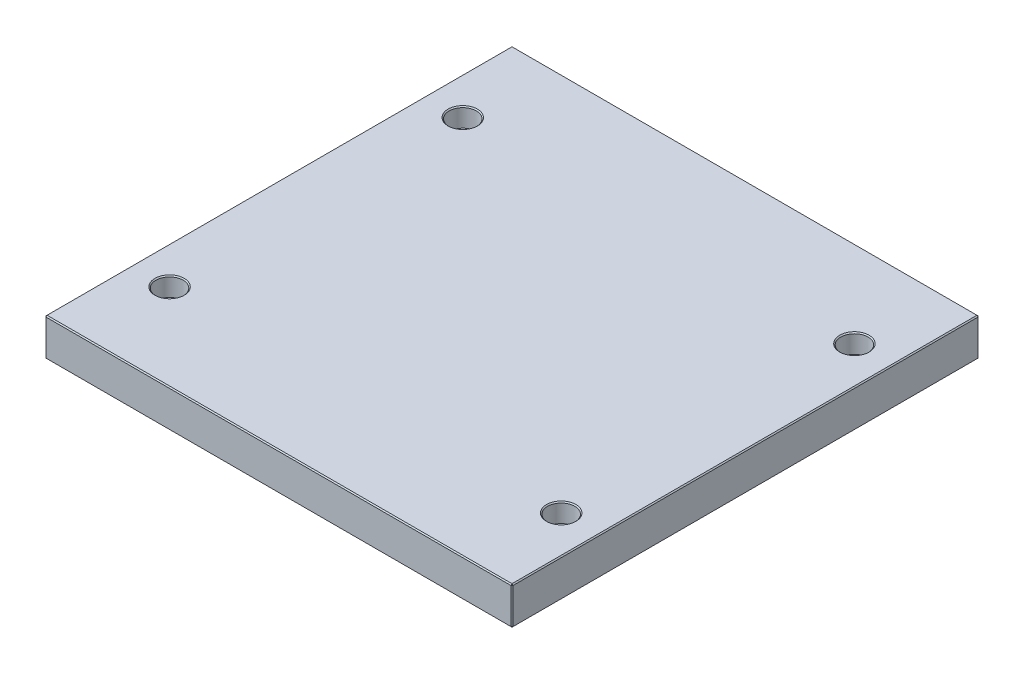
ISO-10303-21;
HEADER;
FILE_DESCRIPTION(('STEP AP214'),'2;1');
FILE_NAME('part.step','',(''),(''),'','','');
FILE_SCHEMA(('AUTOMOTIVE_DESIGN { 1 0 10303 214 1 1 1 1 }'));
ENDSEC;
DATA;
#1=APPLICATION_CONTEXT('core data for automotive mechanical design processes');
#2=APPLICATION_PROTOCOL_DEFINITION('international standard','automotive_design',2000,#1);
#3=PRODUCT_CONTEXT('',#1,'mechanical');
#4=PRODUCT('Part','Part','',(#3));
#5=PRODUCT_RELATED_PRODUCT_CATEGORY('part','',(#4));
#6=PRODUCT_DEFINITION_FORMATION('','',#4);
#7=PRODUCT_DEFINITION_CONTEXT('part definition',#1,'design');
#8=PRODUCT_DEFINITION('design','',#6,#7);
#9=PRODUCT_DEFINITION_SHAPE('','',#8);
#10=(LENGTH_UNIT() NAMED_UNIT(*) SI_UNIT(.MILLI.,.METRE.));
#11=(NAMED_UNIT(*) PLANE_ANGLE_UNIT() SI_UNIT($,.RADIAN.));
#12=(NAMED_UNIT(*) SI_UNIT($,.STERADIAN.) SOLID_ANGLE_UNIT());
#13=UNCERTAINTY_MEASURE_WITH_UNIT(LENGTH_MEASURE(1.E-05),#10,'distance_accuracy_value','');
#14=(GEOMETRIC_REPRESENTATION_CONTEXT(3) GLOBAL_UNCERTAINTY_ASSIGNED_CONTEXT((#13)) GLOBAL_UNIT_ASSIGNED_CONTEXT((#10,
#11,#12)) REPRESENTATION_CONTEXT('',''));
#15=CARTESIAN_POINT('',(0.,0.,0.));
#16=DIRECTION('',(0.,0.,1.));
#17=DIRECTION('',(1.,0.,0.));
#18=AXIS2_PLACEMENT_3D('',#15,#16,#17);
#19=CARTESIAN_POINT('',(-223.,36.,223.));
#20=DIRECTION('',(1.,0.,0.));
#21=DIRECTION('',(0.,0.,-1.));
#22=AXIS2_PLACEMENT_3D('',#19,#20,#21);
#23=PLANE('',#22);
#24=DIRECTION('',(0.,-1.,0.));
#25=VECTOR('',#24,1.);
#26=CARTESIAN_POINT('',(-223.,36.,-222.));
#27=LINE('',#26,#25);
#28=CARTESIAN_POINT('',(-223.,35.,-222.));
#29=VERTEX_POINT('',#28);
#30=CARTESIAN_POINT('',(-223.,1.,-222.));
#31=VERTEX_POINT('',#30);
#32=EDGE_CURVE('E115',#29,#31,#27,.T.);
#33=ORIENTED_EDGE('',*,*,#32,.T.);
#34=DIRECTION('',(0.,0.,1.));
#35=VECTOR('',#34,1.);
#36=CARTESIAN_POINT('',(-223.,1.,223.));
#37=LINE('',#36,#35);
#38=CARTESIAN_POINT('',(-223.,1.,222.));
#39=VERTEX_POINT('',#38);
#40=EDGE_CURVE('E111',#31,#39,#37,.T.);
#41=ORIENTED_EDGE('',*,*,#40,.T.);
#42=DIRECTION('',(0.,1.,0.));
#43=VECTOR('',#42,1.);
#44=CARTESIAN_POINT('',(-223.,36.,222.));
#45=LINE('',#44,#43);
#46=CARTESIAN_POINT('',(-223.,35.,222.));
#47=VERTEX_POINT('',#46);
#48=EDGE_CURVE('E104',#39,#47,#45,.T.);
#49=ORIENTED_EDGE('',*,*,#48,.T.);
#50=DIRECTION('',(0.,0.,-1.));
#51=VECTOR('',#50,1.);
#52=CARTESIAN_POINT('',(-223.,35.,-223.));
#53=LINE('',#52,#51);
#54=EDGE_CURVE('E108',#47,#29,#53,.T.);
#55=ORIENTED_EDGE('',*,*,#54,.T.);
#56=EDGE_LOOP('',(#33,#41,#49,#55));
#57=FACE_BOUND('',#56,.T.);
#58=ADVANCED_FACE('F16',(#57),#23,.F.);
#59=CARTESIAN_POINT('',(223.,36.,223.));
#60=DIRECTION('',(0.,0.,-1.));
#61=DIRECTION('',(-1.,0.,0.));
#62=AXIS2_PLACEMENT_3D('',#59,#60,#61);
#63=PLANE('',#62);
#64=DIRECTION('',(-1.,0.,0.));
#65=VECTOR('',#64,1.);
#66=CARTESIAN_POINT('',(-223.,35.,223.));
#67=LINE('',#66,#65);
#68=CARTESIAN_POINT('',(222.,35.,223.));
#69=VERTEX_POINT('',#68);
#70=CARTESIAN_POINT('',(-222.,35.,223.));
#71=VERTEX_POINT('',#70);
#72=EDGE_CURVE('E170',#69,#71,#67,.T.);
#73=ORIENTED_EDGE('',*,*,#72,.T.);
#74=DIRECTION('',(0.,-1.,0.));
#75=VECTOR('',#74,1.);
#76=CARTESIAN_POINT('',(-222.,36.,223.));
#77=LINE('',#76,#75);
#78=CARTESIAN_POINT('',(-222.,1.,223.));
#79=VERTEX_POINT('',#78);
#80=EDGE_CURVE('E123',#71,#79,#77,.T.);
#81=ORIENTED_EDGE('',*,*,#80,.T.);
#82=DIRECTION('',(1.,0.,0.));
#83=VECTOR('',#82,1.);
#84=CARTESIAN_POINT('',(223.,1.,223.));
#85=LINE('',#84,#83);
#86=CARTESIAN_POINT('',(222.,1.,223.));
#87=VERTEX_POINT('',#86);
#88=EDGE_CURVE('E174',#79,#87,#85,.T.);
#89=ORIENTED_EDGE('',*,*,#88,.T.);
#90=DIRECTION('',(0.,1.,0.));
#91=VECTOR('',#90,1.);
#92=CARTESIAN_POINT('',(222.,36.,223.));
#93=LINE('',#92,#91);
#94=EDGE_CURVE('E172',#87,#69,#93,.T.);
#95=ORIENTED_EDGE('',*,*,#94,.T.);
#96=EDGE_LOOP('',(#73,#81,#89,#95));
#97=FACE_BOUND('',#96,.T.);
#98=ADVANCED_FACE('F317',(#97),#63,.F.);
#99=CARTESIAN_POINT('',(223.,36.,223.));
#100=DIRECTION('',(-1.,0.,0.));
#101=DIRECTION('',(0.,0.,1.));
#102=AXIS2_PLACEMENT_3D('',#99,#100,#101);
#103=PLANE('',#102);
#104=DIRECTION('',(0.,0.,-1.));
#105=VECTOR('',#104,1.);
#106=CARTESIAN_POINT('',(223.,1.,223.));
#107=LINE('',#106,#105);
#108=CARTESIAN_POINT('',(223.,1.,222.));
#109=VERTEX_POINT('',#108);
#110=CARTESIAN_POINT('',(223.,1.,-222.));
#111=VERTEX_POINT('',#110);
#112=EDGE_CURVE('E165',#109,#111,#107,.T.);
#113=ORIENTED_EDGE('',*,*,#112,.T.);
#114=DIRECTION('',(0.,1.,0.));
#115=VECTOR('',#114,1.);
#116=CARTESIAN_POINT('',(223.,36.,-222.));
#117=LINE('',#116,#115);
#118=CARTESIAN_POINT('',(223.,35.,-222.));
#119=VERTEX_POINT('',#118);
#120=EDGE_CURVE('E167',#111,#119,#117,.T.);
#121=ORIENTED_EDGE('',*,*,#120,.T.);
#122=DIRECTION('',(0.,0.,1.));
#123=VECTOR('',#122,1.);
#124=CARTESIAN_POINT('',(223.,35.,223.));
#125=LINE('',#124,#123);
#126=CARTESIAN_POINT('',(223.,35.,222.));
#127=VERTEX_POINT('',#126);
#128=EDGE_CURVE('E161',#119,#127,#125,.T.);
#129=ORIENTED_EDGE('',*,*,#128,.T.);
#130=DIRECTION('',(0.,-1.,0.));
#131=VECTOR('',#130,1.);
#132=CARTESIAN_POINT('',(223.,36.,222.));
#133=LINE('',#132,#131);
#134=EDGE_CURVE('E163',#127,#109,#133,.T.);
#135=ORIENTED_EDGE('',*,*,#134,.T.);
#136=EDGE_LOOP('',(#113,#121,#129,#135));
#137=FACE_BOUND('',#136,.T.);
#138=ADVANCED_FACE('F323',(#137),#103,.F.);
#139=CARTESIAN_POINT('',(223.,36.,-223.));
#140=DIRECTION('',(0.,0.,1.));
#141=DIRECTION('',(1.,0.,0.));
#142=AXIS2_PLACEMENT_3D('',#139,#140,#141);
#143=PLANE('',#142);
#144=DIRECTION('',(0.,-1.,0.));
#145=VECTOR('',#144,1.);
#146=CARTESIAN_POINT('',(222.,36.,-223.));
#147=LINE('',#146,#145);
#148=CARTESIAN_POINT('',(222.,35.,-223.));
#149=VERTEX_POINT('',#148);
#150=CARTESIAN_POINT('',(222.,1.,-223.));
#151=VERTEX_POINT('',#150);
#152=EDGE_CURVE('E154',#149,#151,#147,.T.);
#153=ORIENTED_EDGE('',*,*,#152,.T.);
#154=DIRECTION('',(-1.,0.,0.));
#155=VECTOR('',#154,1.);
#156=CARTESIAN_POINT('',(223.,1.,-223.));
#157=LINE('',#156,#155);
#158=CARTESIAN_POINT('',(-222.,1.,-223.));
#159=VERTEX_POINT('',#158);
#160=EDGE_CURVE('E159',#151,#159,#157,.T.);
#161=ORIENTED_EDGE('',*,*,#160,.T.);
#162=DIRECTION('',(0.,1.,0.));
#163=VECTOR('',#162,1.);
#164=CARTESIAN_POINT('',(-222.,36.,-223.));
#165=LINE('',#164,#163);
#166=CARTESIAN_POINT('',(-222.,35.,-223.));
#167=VERTEX_POINT('',#166);
#168=EDGE_CURVE('E156',#159,#167,#165,.T.);
#169=ORIENTED_EDGE('',*,*,#168,.T.);
#170=DIRECTION('',(1.,0.,0.));
#171=VECTOR('',#170,1.);
#172=CARTESIAN_POINT('',(223.,35.,-223.));
#173=LINE('',#172,#171);
#174=EDGE_CURVE('E152',#167,#149,#173,.T.);
#175=ORIENTED_EDGE('',*,*,#174,.T.);
#176=EDGE_LOOP('',(#153,#161,#169,#175));
#177=FACE_BOUND('',#176,.T.);
#178=ADVANCED_FACE('F465',(#177),#143,.F.);
#179=CARTESIAN_POINT('',(0.,36.,0.));
#180=DIRECTION('',(0.,1.,0.));
#181=DIRECTION('',(0.,0.,1.));
#182=AXIS2_PLACEMENT_3D('',#179,#180,#181);
#183=PLANE('',#182);
#184=CARTESIAN_POINT('',(-187.,36.,140.));
#185=DIRECTION('',(0.,1.,0.));
#186=DIRECTION('',(0.,0.,1.));
#187=AXIS2_PLACEMENT_3D('',#184,#185,#186);
#188=CIRCLE('',#187,14.);
#189=CARTESIAN_POINT('',(-187.,36.,154.));
#190=VERTEX_POINT('',#189);
#191=EDGE_CURVE('E290',#190,#190,#188,.F.);
#192=ORIENTED_EDGE('',*,*,#191,.T.);
#193=EDGE_LOOP('',(#192));
#194=FACE_BOUND('',#193,.T.);
#195=CARTESIAN_POINT('',(187.,36.,140.));
#196=DIRECTION('',(0.,1.,0.));
#197=DIRECTION('',(0.,0.,1.));
#198=AXIS2_PLACEMENT_3D('',#195,#196,#197);
#199=CIRCLE('',#198,14.);
#200=CARTESIAN_POINT('',(187.,36.,154.));
#201=VERTEX_POINT('',#200);
#202=EDGE_CURVE('E287',#201,#201,#199,.F.);
#203=ORIENTED_EDGE('',*,*,#202,.T.);
#204=EDGE_LOOP('',(#203));
#205=FACE_BOUND('',#204,.T.);
#206=CARTESIAN_POINT('',(187.,36.,-140.));
#207=DIRECTION('',(0.,1.,0.));
#208=DIRECTION('',(0.,0.,1.));
#209=AXIS2_PLACEMENT_3D('',#206,#207,#208);
#210=CIRCLE('',#209,14.);
#211=CARTESIAN_POINT('',(187.,36.,-126.));
#212=VERTEX_POINT('',#211);
#213=EDGE_CURVE('E284',#212,#212,#210,.F.);
#214=ORIENTED_EDGE('',*,*,#213,.T.);
#215=EDGE_LOOP('',(#214));
#216=FACE_BOUND('',#215,.T.);
#217=CARTESIAN_POINT('',(-187.,36.,-140.));
#218=DIRECTION('',(0.,1.,0.));
#219=DIRECTION('',(0.,0.,1.));
#220=AXIS2_PLACEMENT_3D('',#217,#218,#219);
#221=CIRCLE('',#220,14.);
#222=CARTESIAN_POINT('',(-187.,36.,-126.));
#223=VERTEX_POINT('',#222);
#224=EDGE_CURVE('E281',#223,#223,#221,.F.);
#225=ORIENTED_EDGE('',*,*,#224,.T.);
#226=EDGE_LOOP('',(#225));
#227=FACE_BOUND('',#226,.T.);
#228=DIRECTION('',(0.,0.,-1.));
#229=VECTOR('',#228,1.);
#230=CARTESIAN_POINT('',(222.,36.,-223.));
#231=LINE('',#230,#229);
#232=CARTESIAN_POINT('',(222.,36.,222.));
#233=VERTEX_POINT('',#232);
#234=CARTESIAN_POINT('',(222.,36.,-222.));
#235=VERTEX_POINT('',#234);
#236=EDGE_CURVE('E31',#233,#235,#231,.T.);
#237=ORIENTED_EDGE('',*,*,#236,.T.);
#238=DIRECTION('',(-1.,0.,0.));
#239=VECTOR('',#238,1.);
#240=CARTESIAN_POINT('',(-223.,36.,-222.));
#241=LINE('',#240,#239);
#242=CARTESIAN_POINT('',(-222.,36.,-222.));
#243=VERTEX_POINT('',#242);
#244=EDGE_CURVE('E190',#235,#243,#241,.T.);
#245=ORIENTED_EDGE('',*,*,#244,.T.);
#246=DIRECTION('',(0.,0.,1.));
#247=VECTOR('',#246,1.);
#248=CARTESIAN_POINT('',(-222.,36.,223.));
#249=LINE('',#248,#247);
#250=CARTESIAN_POINT('',(-222.,36.,222.));
#251=VERTEX_POINT('',#250);
#252=EDGE_CURVE('E186',#243,#251,#249,.T.);
#253=ORIENTED_EDGE('',*,*,#252,.T.);
#254=DIRECTION('',(1.,0.,0.));
#255=VECTOR('',#254,1.);
#256=CARTESIAN_POINT('',(223.,36.,222.));
#257=LINE('',#256,#255);
#258=EDGE_CURVE('E36',#251,#233,#257,.T.);
#259=ORIENTED_EDGE('',*,*,#258,.T.);
#260=EDGE_LOOP('',(#237,#245,#253,#259));
#261=FACE_BOUND('',#260,.T.);
#262=ADVANCED_FACE('F462',(#194,#205,#216,#227,#261),#183,.T.);
#263=CARTESIAN_POINT('',(0.,0.,0.));
#264=DIRECTION('',(0.,1.,0.));
#265=DIRECTION('',(0.,0.,1.));
#266=AXIS2_PLACEMENT_3D('',#263,#264,#265);
#267=PLANE('',#266);
#268=CARTESIAN_POINT('',(187.,0.,-140.));
#269=DIRECTION('',(0.,1.,0.));
#270=DIRECTION('',(0.,0.,1.));
#271=AXIS2_PLACEMENT_3D('',#268,#269,#270);
#272=CIRCLE('',#271,10.0000000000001);
#273=CARTESIAN_POINT('',(187.,0.,-130.));
#274=VERTEX_POINT('',#273);
#275=EDGE_CURVE('E263',#274,#274,#272,.T.);
#276=ORIENTED_EDGE('',*,*,#275,.T.);
#277=EDGE_LOOP('',(#276));
#278=FACE_BOUND('',#277,.T.);
#279=CARTESIAN_POINT('',(187.,0.,140.));
#280=DIRECTION('',(0.,1.,0.));
#281=DIRECTION('',(0.,0.,1.));
#282=AXIS2_PLACEMENT_3D('',#279,#280,#281);
#283=CIRCLE('',#282,10.0000000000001);
#284=CARTESIAN_POINT('',(187.,0.,150.));
#285=VERTEX_POINT('',#284);
#286=EDGE_CURVE('E260',#285,#285,#283,.T.);
#287=ORIENTED_EDGE('',*,*,#286,.T.);
#288=EDGE_LOOP('',(#287));
#289=FACE_BOUND('',#288,.T.);
#290=CARTESIAN_POINT('',(-187.,0.,140.));
#291=DIRECTION('',(0.,1.,0.));
#292=DIRECTION('',(0.,0.,1.));
#293=AXIS2_PLACEMENT_3D('',#290,#291,#292);
#294=CIRCLE('',#293,10.0000000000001);
#295=CARTESIAN_POINT('',(-187.,0.,150.));
#296=VERTEX_POINT('',#295);
#297=EDGE_CURVE('E257',#296,#296,#294,.T.);
#298=ORIENTED_EDGE('',*,*,#297,.T.);
#299=EDGE_LOOP('',(#298));
#300=FACE_BOUND('',#299,.T.);
#301=CARTESIAN_POINT('',(-187.,0.,-140.));
#302=DIRECTION('',(0.,1.,0.));
#303=DIRECTION('',(0.,0.,1.));
#304=AXIS2_PLACEMENT_3D('',#301,#302,#303);
#305=CIRCLE('',#304,10.0000000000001);
#306=CARTESIAN_POINT('',(-187.,0.,-130.));
#307=VERTEX_POINT('',#306);
#308=EDGE_CURVE('E192',#307,#307,#305,.T.);
#309=ORIENTED_EDGE('',*,*,#308,.T.);
#310=EDGE_LOOP('',(#309));
#311=FACE_BOUND('',#310,.T.);
#312=DIRECTION('',(0.,0.,1.));
#313=VECTOR('',#312,1.);
#314=CARTESIAN_POINT('',(222.,0.,0.));
#315=LINE('',#314,#313);
#316=CARTESIAN_POINT('',(222.,0.,-222.));
#317=VERTEX_POINT('',#316);
#318=CARTESIAN_POINT('',(222.,0.,222.));
#319=VERTEX_POINT('',#318);
#320=EDGE_CURVE('E177',#317,#319,#315,.T.);
#321=ORIENTED_EDGE('',*,*,#320,.T.);
#322=DIRECTION('',(-1.,0.,0.));
#323=VECTOR('',#322,1.);
#324=CARTESIAN_POINT('',(0.,0.,222.));
#325=LINE('',#324,#323);
#326=CARTESIAN_POINT('',(-222.,0.,222.));
#327=VERTEX_POINT('',#326);
#328=EDGE_CURVE('E183',#319,#327,#325,.T.);
#329=ORIENTED_EDGE('',*,*,#328,.T.);
#330=DIRECTION('',(0.,0.,-1.));
#331=VECTOR('',#330,1.);
#332=CARTESIAN_POINT('',(-222.,0.,0.));
#333=LINE('',#332,#331);
#334=CARTESIAN_POINT('',(-222.,0.,-222.));
#335=VERTEX_POINT('',#334);
#336=EDGE_CURVE('E181',#327,#335,#333,.T.);
#337=ORIENTED_EDGE('',*,*,#336,.T.);
#338=DIRECTION('',(1.,0.,0.));
#339=VECTOR('',#338,1.);
#340=CARTESIAN_POINT('',(0.,0.,-222.));
#341=LINE('',#340,#339);
#342=EDGE_CURVE('E179',#335,#317,#341,.T.);
#343=ORIENTED_EDGE('',*,*,#342,.T.);
#344=EDGE_LOOP('',(#321,#329,#337,#343));
#345=FACE_BOUND('',#344,.T.);
#346=ADVANCED_FACE('F402',(#278,#289,#300,#311,#345),#267,.F.);
#347=CARTESIAN_POINT('',(223.,36.,222.));
#348=DIRECTION('',(-0.707106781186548,0.,-0.707106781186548));
#349=DIRECTION('',(0.,-1.,0.));
#350=AXIS2_PLACEMENT_3D('',#347,#348,#349);
#351=PLANE('',#350);
#352=DIRECTION('',(-0.707106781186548,0.,0.707106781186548));
#353=VECTOR('',#352,1.);
#354=CARTESIAN_POINT('',(222.,35.,223.));
#355=LINE('',#354,#353);
#356=EDGE_CURVE('E141',#69,#127,#355,.F.);
#357=ORIENTED_EDGE('',*,*,#356,.F.);
#358=ORIENTED_EDGE('',*,*,#94,.F.);
#359=DIRECTION('',(0.707106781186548,0.,-0.707106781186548));
#360=VECTOR('',#359,1.);
#361=CARTESIAN_POINT('',(222.,1.,223.));
#362=LINE('',#361,#360);
#363=EDGE_CURVE('E144',#109,#87,#362,.F.);
#364=ORIENTED_EDGE('',*,*,#363,.F.);
#365=ORIENTED_EDGE('',*,*,#134,.F.);
#366=EDGE_LOOP('',(#357,#358,#364,#365));
#367=FACE_BOUND('',#366,.T.);
#368=ADVANCED_FACE('F398',(#367),#351,.F.);
#369=CARTESIAN_POINT('',(222.,35.,223.));
#370=DIRECTION('',(0.577350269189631,0.577350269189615,0.577350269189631));
#371=DIRECTION('',(0.707106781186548,0.,-0.707106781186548));
#372=AXIS2_PLACEMENT_3D('',#369,#370,#371);
#373=PLANE('',#372);
#374=DIRECTION('',(0.,-0.707106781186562,0.707106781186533));
#375=VECTOR('',#374,1.);
#376=CARTESIAN_POINT('',(222.,35.,223.));
#377=LINE('',#376,#375);
#378=EDGE_CURVE('E235',#69,#233,#377,.F.);
#379=ORIENTED_EDGE('',*,*,#378,.F.);
#380=ORIENTED_EDGE('',*,*,#356,.T.);
#381=DIRECTION('',(-0.707106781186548,0.707106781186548,0.));
#382=VECTOR('',#381,1.);
#383=CARTESIAN_POINT('',(222.5,35.5,222.));
#384=LINE('',#383,#382);
#385=EDGE_CURVE('E237',#233,#127,#384,.F.);
#386=ORIENTED_EDGE('',*,*,#385,.F.);
#387=EDGE_LOOP('',(#379,#380,#386));
#388=FACE_BOUND('',#387,.T.);
#389=ADVANCED_FACE('F394',(#388),#373,.T.);
#390=CARTESIAN_POINT('',(222.,1.,223.));
#391=DIRECTION('',(0.577350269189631,-0.577350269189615,0.577350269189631));
#392=DIRECTION('',(0.707106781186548,0.,-0.707106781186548));
#393=AXIS2_PLACEMENT_3D('',#390,#391,#392);
#394=PLANE('',#393);
#395=DIRECTION('',(-0.707106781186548,-0.707106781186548,0.));
#396=VECTOR('',#395,1.);
#397=CARTESIAN_POINT('',(222.5,0.499999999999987,222.));
#398=LINE('',#397,#396);
#399=EDGE_CURVE('E229',#109,#319,#398,.T.);
#400=ORIENTED_EDGE('',*,*,#399,.F.);
#401=ORIENTED_EDGE('',*,*,#363,.T.);
#402=DIRECTION('',(0.,0.707106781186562,0.707106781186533));
#403=VECTOR('',#402,1.);
#404=CARTESIAN_POINT('',(222.,1.,223.));
#405=LINE('',#404,#403);
#406=EDGE_CURVE('E232',#319,#87,#405,.T.);
#407=ORIENTED_EDGE('',*,*,#406,.F.);
#408=EDGE_LOOP('',(#400,#401,#407));
#409=FACE_BOUND('',#408,.T.);
#410=ADVANCED_FACE('F390',(#409),#394,.T.);
#411=CARTESIAN_POINT('',(222.,36.,0.));
#412=DIRECTION('',(0.707106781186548,0.707106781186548,0.));
#413=DIRECTION('',(0.,0.,1.));
#414=AXIS2_PLACEMENT_3D('',#411,#412,#413);
#415=PLANE('',#414);
#416=ORIENTED_EDGE('',*,*,#385,.T.);
#417=ORIENTED_EDGE('',*,*,#128,.F.);
#418=DIRECTION('',(0.707106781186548,-0.707106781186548,0.));
#419=VECTOR('',#418,1.);
#420=CARTESIAN_POINT('',(223.,35.,-222.));
#421=LINE('',#420,#419);
#422=EDGE_CURVE('E224',#235,#119,#421,.T.);
#423=ORIENTED_EDGE('',*,*,#422,.F.);
#424=ORIENTED_EDGE('',*,*,#236,.F.);
#425=EDGE_LOOP('',(#416,#417,#423,#424));
#426=FACE_BOUND('',#425,.T.);
#427=ADVANCED_FACE('F386',(#426),#415,.T.);
#428=CARTESIAN_POINT('',(0.,36.,222.));
#429=DIRECTION('',(0.,0.707106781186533,0.707106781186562));
#430=DIRECTION('',(-1.,0.,0.));
#431=AXIS2_PLACEMENT_3D('',#428,#429,#430);
#432=PLANE('',#431);
#433=ORIENTED_EDGE('',*,*,#378,.T.);
#434=ORIENTED_EDGE('',*,*,#258,.F.);
#435=DIRECTION('',(0.,0.707106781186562,-0.707106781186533));
#436=VECTOR('',#435,1.);
#437=CARTESIAN_POINT('',(-222.,35.5,222.5));
#438=LINE('',#437,#436);
#439=EDGE_CURVE('E127',#71,#251,#438,.T.);
#440=ORIENTED_EDGE('',*,*,#439,.F.);
#441=ORIENTED_EDGE('',*,*,#72,.F.);
#442=EDGE_LOOP('',(#433,#434,#440,#441));
#443=FACE_BOUND('',#442,.T.);
#444=ADVANCED_FACE('F383',(#443),#432,.T.);
#445=CARTESIAN_POINT('',(-222.,36.,223.));
#446=DIRECTION('',(0.707106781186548,0.,-0.707106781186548));
#447=DIRECTION('',(0.,-1.,0.));
#448=AXIS2_PLACEMENT_3D('',#445,#446,#447);
#449=PLANE('',#448);
#450=DIRECTION('',(0.707106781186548,0.,0.707106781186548));
#451=VECTOR('',#450,1.);
#452=CARTESIAN_POINT('',(-222.,1.,223.));
#453=LINE('',#452,#451);
#454=EDGE_CURVE('E128',#79,#39,#453,.F.);
#455=ORIENTED_EDGE('',*,*,#454,.F.);
#456=ORIENTED_EDGE('',*,*,#80,.F.);
#457=DIRECTION('',(-0.707106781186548,0.,-0.707106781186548));
#458=VECTOR('',#457,1.);
#459=CARTESIAN_POINT('',(-223.,35.,222.));
#460=LINE('',#459,#458);
#461=EDGE_CURVE('E119',#47,#71,#460,.F.);
#462=ORIENTED_EDGE('',*,*,#461,.F.);
#463=ORIENTED_EDGE('',*,*,#48,.F.);
#464=EDGE_LOOP('',(#455,#456,#462,#463));
#465=FACE_BOUND('',#464,.T.);
#466=ADVANCED_FACE('F121',(#465),#449,.F.);
#467=CARTESIAN_POINT('',(223.,1.,223.));
#468=DIRECTION('',(0.,0.707106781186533,-0.707106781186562));
#469=DIRECTION('',(1.,0.,0.));
#470=AXIS2_PLACEMENT_3D('',#467,#468,#469);
#471=PLANE('',#470);
#472=ORIENTED_EDGE('',*,*,#406,.T.);
#473=ORIENTED_EDGE('',*,*,#88,.F.);
#474=DIRECTION('',(0.,-0.707106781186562,-0.707106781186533));
#475=VECTOR('',#474,1.);
#476=CARTESIAN_POINT('',(-222.,1.,223.));
#477=LINE('',#476,#475);
#478=EDGE_CURVE('E220',#327,#79,#477,.F.);
#479=ORIENTED_EDGE('',*,*,#478,.F.);
#480=ORIENTED_EDGE('',*,*,#328,.F.);
#481=EDGE_LOOP('',(#472,#473,#479,#480));
#482=FACE_BOUND('',#481,.T.);
#483=ADVANCED_FACE('F376',(#482),#471,.F.);
#484=CARTESIAN_POINT('',(223.,1.,223.));
#485=DIRECTION('',(-0.707106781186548,0.707106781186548,0.));
#486=DIRECTION('',(0.,0.,-1.));
#487=AXIS2_PLACEMENT_3D('',#484,#485,#486);
#488=PLANE('',#487);
#489=ORIENTED_EDGE('',*,*,#399,.T.);
#490=ORIENTED_EDGE('',*,*,#320,.F.);
#491=DIRECTION('',(0.707106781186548,0.707106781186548,0.));
#492=VECTOR('',#491,1.);
#493=CARTESIAN_POINT('',(222.5,0.499999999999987,-222.));
#494=LINE('',#493,#492);
#495=EDGE_CURVE('E217',#111,#317,#494,.F.);
#496=ORIENTED_EDGE('',*,*,#495,.F.);
#497=ORIENTED_EDGE('',*,*,#112,.F.);
#498=EDGE_LOOP('',(#489,#490,#496,#497));
#499=FACE_BOUND('',#498,.T.);
#500=ADVANCED_FACE('F372',(#499),#488,.F.);
#501=CARTESIAN_POINT('',(222.,36.,-223.));
#502=DIRECTION('',(-0.707106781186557,0.,0.707106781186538));
#503=DIRECTION('',(0.,-1.,0.));
#504=AXIS2_PLACEMENT_3D('',#501,#502,#503);
#505=PLANE('',#504);
#506=DIRECTION('',(0.707106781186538,0.,0.707106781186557));
#507=VECTOR('',#506,1.);
#508=CARTESIAN_POINT('',(223.,35.,-222.));
#509=LINE('',#508,#507);
#510=EDGE_CURVE('E226',#119,#149,#509,.F.);
#511=ORIENTED_EDGE('',*,*,#510,.F.);
#512=ORIENTED_EDGE('',*,*,#120,.F.);
#513=DIRECTION('',(-0.707106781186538,0.,-0.707106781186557));
#514=VECTOR('',#513,1.);
#515=CARTESIAN_POINT('',(222.,1.,-223.));
#516=LINE('',#515,#514);
#517=EDGE_CURVE('E214',#151,#111,#516,.F.);
#518=ORIENTED_EDGE('',*,*,#517,.F.);
#519=ORIENTED_EDGE('',*,*,#152,.F.);
#520=EDGE_LOOP('',(#511,#512,#518,#519));
#521=FACE_BOUND('',#520,.T.);
#522=ADVANCED_FACE('F368',(#521),#505,.F.);
#523=CARTESIAN_POINT('',(223.,35.,-222.));
#524=DIRECTION('',(0.577350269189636,0.57735026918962,-0.57735026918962));
#525=DIRECTION('',(-0.707106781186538,0.,-0.707106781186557));
#526=AXIS2_PLACEMENT_3D('',#523,#524,#525);
#527=PLANE('',#526);
#528=ORIENTED_EDGE('',*,*,#422,.T.);
#529=ORIENTED_EDGE('',*,*,#510,.T.);
#530=DIRECTION('',(0.,0.707106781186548,0.707106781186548));
#531=VECTOR('',#530,1.);
#532=CARTESIAN_POINT('',(222.,35.5,-222.5));
#533=LINE('',#532,#531);
#534=EDGE_CURVE('E135',#235,#149,#533,.F.);
#535=ORIENTED_EDGE('',*,*,#534,.F.);
#536=EDGE_LOOP('',(#528,#529,#535));
#537=FACE_BOUND('',#536,.T.);
#538=ADVANCED_FACE('F365',(#537),#527,.T.);
#539=CARTESIAN_POINT('',(-223.,35.,222.));
#540=DIRECTION('',(-0.577350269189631,0.577350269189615,0.577350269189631));
#541=DIRECTION('',(0.707106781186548,0.,0.707106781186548));
#542=AXIS2_PLACEMENT_3D('',#539,#540,#541);
#543=PLANE('',#542);
#544=ORIENTED_EDGE('',*,*,#461,.T.);
#545=ORIENTED_EDGE('',*,*,#439,.T.);
#546=DIRECTION('',(-0.707106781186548,-0.707106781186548,0.));
#547=VECTOR('',#546,1.);
#548=CARTESIAN_POINT('',(-223.,35.,222.));
#549=LINE('',#548,#547);
#550=EDGE_CURVE('E131',#47,#251,#549,.F.);
#551=ORIENTED_EDGE('',*,*,#550,.F.);
#552=EDGE_LOOP('',(#544,#545,#551));
#553=FACE_BOUND('',#552,.T.);
#554=ADVANCED_FACE('F132',(#553),#543,.T.);
#555=CARTESIAN_POINT('',(-222.,1.,223.));
#556=DIRECTION('',(-0.577350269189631,-0.577350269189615,0.577350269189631));
#557=DIRECTION('',(0.707106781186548,0.,0.707106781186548));
#558=AXIS2_PLACEMENT_3D('',#555,#556,#557);
#559=PLANE('',#558);
#560=ORIENTED_EDGE('',*,*,#478,.T.);
#561=ORIENTED_EDGE('',*,*,#454,.T.);
#562=DIRECTION('',(-0.707106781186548,0.707106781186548,0.));
#563=VECTOR('',#562,1.);
#564=CARTESIAN_POINT('',(-222.5,0.499999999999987,222.));
#565=LINE('',#564,#563);
#566=EDGE_CURVE('E136',#327,#39,#565,.T.);
#567=ORIENTED_EDGE('',*,*,#566,.F.);
#568=EDGE_LOOP('',(#560,#561,#567));
#569=FACE_BOUND('',#568,.T.);
#570=ADVANCED_FACE('F358',(#569),#559,.T.);
#571=CARTESIAN_POINT('',(222.,1.,-223.));
#572=DIRECTION('',(0.577350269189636,-0.57735026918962,-0.57735026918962));
#573=DIRECTION('',(-0.707106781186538,0.,-0.707106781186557));
#574=AXIS2_PLACEMENT_3D('',#571,#572,#573);
#575=PLANE('',#574);
#576=ORIENTED_EDGE('',*,*,#517,.T.);
#577=ORIENTED_EDGE('',*,*,#495,.T.);
#578=DIRECTION('',(0.,-0.707106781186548,0.707106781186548));
#579=VECTOR('',#578,1.);
#580=CARTESIAN_POINT('',(222.,1.,-223.));
#581=LINE('',#580,#579);
#582=EDGE_CURVE('E207',#151,#317,#581,.T.);
#583=ORIENTED_EDGE('',*,*,#582,.F.);
#584=EDGE_LOOP('',(#576,#577,#583));
#585=FACE_BOUND('',#584,.T.);
#586=ADVANCED_FACE('F354',(#585),#575,.T.);
#587=CARTESIAN_POINT('',(0.,36.,-222.));
#588=DIRECTION('',(0.,0.707106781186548,-0.707106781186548));
#589=DIRECTION('',(1.,0.,0.));
#590=AXIS2_PLACEMENT_3D('',#587,#588,#589);
#591=PLANE('',#590);
#592=ORIENTED_EDGE('',*,*,#534,.T.);
#593=ORIENTED_EDGE('',*,*,#174,.F.);
#594=DIRECTION('',(0.,-0.707106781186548,-0.707106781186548));
#595=VECTOR('',#594,1.);
#596=CARTESIAN_POINT('',(-222.,35.,-223.));
#597=LINE('',#596,#595);
#598=EDGE_CURVE('E204',#243,#167,#597,.T.);
#599=ORIENTED_EDGE('',*,*,#598,.F.);
#600=ORIENTED_EDGE('',*,*,#244,.F.);
#601=EDGE_LOOP('',(#592,#593,#599,#600));
#602=FACE_BOUND('',#601,.T.);
#603=ADVANCED_FACE('F351',(#602),#591,.T.);
#604=CARTESIAN_POINT('',(-222.,36.,0.));
#605=DIRECTION('',(-0.707106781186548,0.707106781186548,0.));
#606=DIRECTION('',(0.,0.,-1.));
#607=AXIS2_PLACEMENT_3D('',#604,#605,#606);
#608=PLANE('',#607);
#609=ORIENTED_EDGE('',*,*,#550,.T.);
#610=ORIENTED_EDGE('',*,*,#252,.F.);
#611=DIRECTION('',(0.707106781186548,0.707106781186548,0.));
#612=VECTOR('',#611,1.);
#613=CARTESIAN_POINT('',(-222.5,35.5,-222.));
#614=LINE('',#613,#612);
#615=EDGE_CURVE('E139',#29,#243,#614,.T.);
#616=ORIENTED_EDGE('',*,*,#615,.F.);
#617=ORIENTED_EDGE('',*,*,#54,.F.);
#618=EDGE_LOOP('',(#609,#610,#616,#617));
#619=FACE_BOUND('',#618,.T.);
#620=ADVANCED_FACE('F138',(#619),#608,.T.);
#621=CARTESIAN_POINT('',(-223.,1.,223.));
#622=DIRECTION('',(0.707106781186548,0.707106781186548,0.));
#623=DIRECTION('',(0.,0.,1.));
#624=AXIS2_PLACEMENT_3D('',#621,#622,#623);
#625=PLANE('',#624);
#626=ORIENTED_EDGE('',*,*,#566,.T.);
#627=ORIENTED_EDGE('',*,*,#40,.F.);
#628=DIRECTION('',(0.707106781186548,-0.707106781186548,0.));
#629=VECTOR('',#628,1.);
#630=CARTESIAN_POINT('',(-223.,1.,-222.));
#631=LINE('',#630,#629);
#632=EDGE_CURVE('E200',#335,#31,#631,.F.);
#633=ORIENTED_EDGE('',*,*,#632,.F.);
#634=ORIENTED_EDGE('',*,*,#336,.F.);
#635=EDGE_LOOP('',(#626,#627,#633,#634));
#636=FACE_BOUND('',#635,.T.);
#637=ADVANCED_FACE('F344',(#636),#625,.F.);
#638=CARTESIAN_POINT('',(223.,1.,-223.));
#639=DIRECTION('',(0.,0.707106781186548,0.707106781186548));
#640=DIRECTION('',(-1.,0.,0.));
#641=AXIS2_PLACEMENT_3D('',#638,#639,#640);
#642=PLANE('',#641);
#643=ORIENTED_EDGE('',*,*,#582,.T.);
#644=ORIENTED_EDGE('',*,*,#342,.F.);
#645=DIRECTION('',(0.,0.707106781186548,-0.707106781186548));
#646=VECTOR('',#645,1.);
#647=CARTESIAN_POINT('',(-222.,0.5,-222.5));
#648=LINE('',#647,#646);
#649=EDGE_CURVE('E197',#159,#335,#648,.F.);
#650=ORIENTED_EDGE('',*,*,#649,.F.);
#651=ORIENTED_EDGE('',*,*,#160,.F.);
#652=EDGE_LOOP('',(#643,#644,#650,#651));
#653=FACE_BOUND('',#652,.T.);
#654=ADVANCED_FACE('F340',(#653),#642,.F.);
#655=CARTESIAN_POINT('',(-222.,35.,-223.));
#656=DIRECTION('',(-0.577350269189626,0.577350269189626,-0.577350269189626));
#657=DIRECTION('',(-0.707106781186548,0.,0.707106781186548));
#658=AXIS2_PLACEMENT_3D('',#655,#656,#657);
#659=PLANE('',#658);
#660=ORIENTED_EDGE('',*,*,#615,.T.);
#661=ORIENTED_EDGE('',*,*,#598,.T.);
#662=DIRECTION('',(0.707106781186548,0.,-0.707106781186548));
#663=VECTOR('',#662,1.);
#664=CARTESIAN_POINT('',(-222.,35.,-223.));
#665=LINE('',#664,#663);
#666=EDGE_CURVE('E195',#29,#167,#665,.T.);
#667=ORIENTED_EDGE('',*,*,#666,.F.);
#668=EDGE_LOOP('',(#660,#661,#667));
#669=FACE_BOUND('',#668,.T.);
#670=ADVANCED_FACE('F336',(#669),#659,.T.);
#671=CARTESIAN_POINT('',(-223.,1.,-222.));
#672=DIRECTION('',(-0.577350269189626,-0.577350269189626,-0.577350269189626));
#673=DIRECTION('',(-0.707106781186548,0.,0.707106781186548));
#674=AXIS2_PLACEMENT_3D('',#671,#672,#673);
#675=PLANE('',#674);
#676=ORIENTED_EDGE('',*,*,#649,.T.);
#677=ORIENTED_EDGE('',*,*,#632,.T.);
#678=DIRECTION('',(-0.707106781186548,0.,0.707106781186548));
#679=VECTOR('',#678,1.);
#680=CARTESIAN_POINT('',(-223.,1.,-222.));
#681=LINE('',#680,#679);
#682=EDGE_CURVE('E193',#159,#31,#681,.T.);
#683=ORIENTED_EDGE('',*,*,#682,.F.);
#684=EDGE_LOOP('',(#676,#677,#683));
#685=FACE_BOUND('',#684,.T.);
#686=ADVANCED_FACE('F332',(#685),#675,.T.);
#687=CARTESIAN_POINT('',(-223.,36.,-222.));
#688=DIRECTION('',(0.707106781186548,0.,0.707106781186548));
#689=DIRECTION('',(0.,-1.,0.));
#690=AXIS2_PLACEMENT_3D('',#687,#688,#689);
#691=PLANE('',#690);
#692=ORIENTED_EDGE('',*,*,#666,.T.);
#693=ORIENTED_EDGE('',*,*,#168,.F.);
#694=ORIENTED_EDGE('',*,*,#682,.T.);
#695=ORIENTED_EDGE('',*,*,#32,.F.);
#696=EDGE_LOOP('',(#692,#693,#694,#695));
#697=FACE_BOUND('',#696,.T.);
#698=ADVANCED_FACE('F328',(#697),#691,.F.);
#699=CARTESIAN_POINT('',(-187.,18.,-140.));
#700=DIRECTION('',(0.,1.,0.));
#701=DIRECTION('',(0.,0.,1.));
#702=AXIS2_PLACEMENT_3D('',#699,#700,#701);
#703=CYLINDRICAL_SURFACE('',#702,13.);
#704=CARTESIAN_POINT('',(-187.,35.,-140.));
#705=DIRECTION('',(0.,1.,0.));
#706=DIRECTION('',(0.,0.,1.));
#707=AXIS2_PLACEMENT_3D('',#704,#705,#706);
#708=CIRCLE('',#707,13.);
#709=CARTESIAN_POINT('',(-187.,35.,-127.));
#710=VERTEX_POINT('',#709);
#711=EDGE_CURVE('E10',#710,#710,#708,.T.);
#712=ORIENTED_EDGE('',*,*,#711,.T.);
#713=EDGE_LOOP('',(#712));
#714=FACE_BOUND('',#713,.T.);
#715=CARTESIAN_POINT('',(-187.,18.,-140.));
#716=DIRECTION('',(0.,1.,0.));
#717=DIRECTION('',(0.,0.,1.));
#718=AXIS2_PLACEMENT_3D('',#715,#716,#717);
#719=CIRCLE('',#718,13.);
#720=CARTESIAN_POINT('',(-187.,18.,-127.));
#721=VERTEX_POINT('',#720);
#722=EDGE_CURVE('E147',#721,#721,#719,.T.);
#723=ORIENTED_EDGE('',*,*,#722,.F.);
#724=EDGE_LOOP('',(#723));
#725=FACE_BOUND('',#724,.T.);
#726=ADVANCED_FACE('F331',(#714,#725),#703,.F.);
#727=CARTESIAN_POINT('',(-187.,18.,-140.));
#728=DIRECTION('',(0.,1.,0.));
#729=DIRECTION('',(0.,0.,1.));
#730=AXIS2_PLACEMENT_3D('',#727,#728,#729);
#731=PLANE('',#730);
#732=CARTESIAN_POINT('',(-187.,18.,-140.));
#733=DIRECTION('',(0.,1.,0.));
#734=DIRECTION('',(0.,0.,1.));
#735=AXIS2_PLACEMENT_3D('',#732,#733,#734);
#736=CIRCLE('',#735,9.);
#737=CARTESIAN_POINT('',(-187.,18.,-131.));
#738=VERTEX_POINT('',#737);
#739=EDGE_CURVE('E251',#738,#738,#736,.T.);
#740=ORIENTED_EDGE('',*,*,#739,.F.);
#741=EDGE_LOOP('',(#740));
#742=FACE_BOUND('',#741,.T.);
#743=ORIENTED_EDGE('',*,*,#722,.T.);
#744=EDGE_LOOP('',(#743));
#745=FACE_BOUND('',#744,.T.);
#746=ADVANCED_FACE('F450',(#742,#745),#731,.T.);
#747=CARTESIAN_POINT('',(187.,18.,-140.));
#748=DIRECTION('',(0.,1.,0.));
#749=DIRECTION('',(0.,0.,1.));
#750=AXIS2_PLACEMENT_3D('',#747,#748,#749);
#751=CYLINDRICAL_SURFACE('',#750,13.);
#752=CARTESIAN_POINT('',(187.,35.,-140.));
#753=DIRECTION('',(0.,1.,0.));
#754=DIRECTION('',(0.,0.,1.));
#755=AXIS2_PLACEMENT_3D('',#752,#753,#754);
#756=CIRCLE('',#755,13.);
#757=CARTESIAN_POINT('',(187.,35.,-127.));
#758=VERTEX_POINT('',#757);
#759=EDGE_CURVE('E24',#758,#758,#756,.T.);
#760=ORIENTED_EDGE('',*,*,#759,.T.);
#761=EDGE_LOOP('',(#760));
#762=FACE_BOUND('',#761,.T.);
#763=CARTESIAN_POINT('',(187.,18.,-140.));
#764=DIRECTION('',(0.,1.,0.));
#765=DIRECTION('',(0.,0.,1.));
#766=AXIS2_PLACEMENT_3D('',#763,#764,#765);
#767=CIRCLE('',#766,13.);
#768=CARTESIAN_POINT('',(187.,18.,-127.));
#769=VERTEX_POINT('',#768);
#770=EDGE_CURVE('E441',#769,#769,#767,.T.);
#771=ORIENTED_EDGE('',*,*,#770,.F.);
#772=EDGE_LOOP('',(#771));
#773=FACE_BOUND('',#772,.T.);
#774=ADVANCED_FACE('F298',(#762,#773),#751,.F.);
#775=CARTESIAN_POINT('',(187.,18.,-140.));
#776=DIRECTION('',(0.,1.,0.));
#777=DIRECTION('',(0.,0.,1.));
#778=AXIS2_PLACEMENT_3D('',#775,#776,#777);
#779=PLANE('',#778);
#780=CARTESIAN_POINT('',(187.,18.,-140.));
#781=DIRECTION('',(0.,1.,0.));
#782=DIRECTION('',(0.,0.,1.));
#783=AXIS2_PLACEMENT_3D('',#780,#781,#782);
#784=CIRCLE('',#783,9.);
#785=CARTESIAN_POINT('',(187.,18.,-131.));
#786=VERTEX_POINT('',#785);
#787=EDGE_CURVE('E248',#786,#786,#784,.T.);
#788=ORIENTED_EDGE('',*,*,#787,.F.);
#789=EDGE_LOOP('',(#788));
#790=FACE_BOUND('',#789,.T.);
#791=ORIENTED_EDGE('',*,*,#770,.T.);
#792=EDGE_LOOP('',(#791));
#793=FACE_BOUND('',#792,.T.);
#794=ADVANCED_FACE('F738',(#790,#793),#779,.T.);
#795=CARTESIAN_POINT('',(187.,18.,140.));
#796=DIRECTION('',(0.,1.,0.));
#797=DIRECTION('',(0.,0.,1.));
#798=AXIS2_PLACEMENT_3D('',#795,#796,#797);
#799=CYLINDRICAL_SURFACE('',#798,13.);
#800=CARTESIAN_POINT('',(187.,35.,140.));
#801=DIRECTION('',(0.,1.,0.));
#802=DIRECTION('',(0.,0.,1.));
#803=AXIS2_PLACEMENT_3D('',#800,#801,#802);
#804=CIRCLE('',#803,13.);
#805=CARTESIAN_POINT('',(187.,35.,153.));
#806=VERTEX_POINT('',#805);
#807=EDGE_CURVE('E293',#806,#806,#804,.T.);
#808=ORIENTED_EDGE('',*,*,#807,.T.);
#809=EDGE_LOOP('',(#808));
#810=FACE_BOUND('',#809,.T.);
#811=CARTESIAN_POINT('',(187.,18.,140.));
#812=DIRECTION('',(0.,1.,0.));
#813=DIRECTION('',(0.,0.,1.));
#814=AXIS2_PLACEMENT_3D('',#811,#812,#813);
#815=CIRCLE('',#814,13.);
#816=CARTESIAN_POINT('',(187.,18.,153.));
#817=VERTEX_POINT('',#816);
#818=EDGE_CURVE('E439',#817,#817,#815,.T.);
#819=ORIENTED_EDGE('',*,*,#818,.F.);
#820=EDGE_LOOP('',(#819));
#821=FACE_BOUND('',#820,.T.);
#822=ADVANCED_FACE('F730',(#810,#821),#799,.F.);
#823=CARTESIAN_POINT('',(187.,18.,140.));
#824=DIRECTION('',(0.,1.,0.));
#825=DIRECTION('',(0.,0.,1.));
#826=AXIS2_PLACEMENT_3D('',#823,#824,#825);
#827=PLANE('',#826);
#828=CARTESIAN_POINT('',(187.,18.,140.));
#829=DIRECTION('',(0.,1.,0.));
#830=DIRECTION('',(0.,0.,1.));
#831=AXIS2_PLACEMENT_3D('',#828,#829,#830);
#832=CIRCLE('',#831,9.);
#833=CARTESIAN_POINT('',(187.,18.,149.));
#834=VERTEX_POINT('',#833);
#835=EDGE_CURVE('E245',#834,#834,#832,.T.);
#836=ORIENTED_EDGE('',*,*,#835,.F.);
#837=EDGE_LOOP('',(#836));
#838=FACE_BOUND('',#837,.T.);
#839=ORIENTED_EDGE('',*,*,#818,.T.);
#840=EDGE_LOOP('',(#839));
#841=FACE_BOUND('',#840,.T.);
#842=ADVANCED_FACE('F434',(#838,#841),#827,.T.);
#843=CARTESIAN_POINT('',(-187.,18.,140.));
#844=DIRECTION('',(0.,1.,0.));
#845=DIRECTION('',(0.,0.,1.));
#846=AXIS2_PLACEMENT_3D('',#843,#844,#845);
#847=CYLINDRICAL_SURFACE('',#846,13.);
#848=CARTESIAN_POINT('',(-187.,35.,140.));
#849=DIRECTION('',(0.,1.,0.));
#850=DIRECTION('',(0.,0.,1.));
#851=AXIS2_PLACEMENT_3D('',#848,#849,#850);
#852=CIRCLE('',#851,13.);
#853=CARTESIAN_POINT('',(-187.,35.,153.));
#854=VERTEX_POINT('',#853);
#855=EDGE_CURVE('E278',#854,#854,#852,.T.);
#856=ORIENTED_EDGE('',*,*,#855,.T.);
#857=EDGE_LOOP('',(#856));
#858=FACE_BOUND('',#857,.T.);
#859=CARTESIAN_POINT('',(-187.,18.,140.));
#860=DIRECTION('',(0.,1.,0.));
#861=DIRECTION('',(0.,0.,1.));
#862=AXIS2_PLACEMENT_3D('',#859,#860,#861);
#863=CIRCLE('',#862,13.);
#864=CARTESIAN_POINT('',(-187.,18.,153.));
#865=VERTEX_POINT('',#864);
#866=EDGE_CURVE('E254',#865,#865,#863,.T.);
#867=ORIENTED_EDGE('',*,*,#866,.F.);
#868=EDGE_LOOP('',(#867));
#869=FACE_BOUND('',#868,.T.);
#870=ADVANCED_FACE('F430',(#858,#869),#847,.F.);
#871=CARTESIAN_POINT('',(-187.,18.,140.));
#872=DIRECTION('',(0.,1.,0.));
#873=DIRECTION('',(0.,0.,1.));
#874=AXIS2_PLACEMENT_3D('',#871,#872,#873);
#875=PLANE('',#874);
#876=CARTESIAN_POINT('',(-187.,18.,140.));
#877=DIRECTION('',(0.,1.,0.));
#878=DIRECTION('',(0.,0.,1.));
#879=AXIS2_PLACEMENT_3D('',#876,#877,#878);
#880=CIRCLE('',#879,9.);
#881=CARTESIAN_POINT('',(-187.,18.,149.));
#882=VERTEX_POINT('',#881);
#883=EDGE_CURVE('E242',#882,#882,#880,.T.);
#884=ORIENTED_EDGE('',*,*,#883,.F.);
#885=EDGE_LOOP('',(#884));
#886=FACE_BOUND('',#885,.T.);
#887=ORIENTED_EDGE('',*,*,#866,.T.);
#888=EDGE_LOOP('',(#887));
#889=FACE_BOUND('',#888,.T.);
#890=ADVANCED_FACE('F433',(#886,#889),#875,.T.);
#891=CARTESIAN_POINT('',(-187.,0.,140.));
#892=DIRECTION('',(0.,1.,0.));
#893=DIRECTION('',(0.,0.,1.));
#894=AXIS2_PLACEMENT_3D('',#891,#892,#893);
#895=CYLINDRICAL_SURFACE('',#894,9.);
#896=CARTESIAN_POINT('',(-187.,1.00000000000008,140.));
#897=DIRECTION('',(0.,1.,0.));
#898=DIRECTION('',(0.,0.,1.));
#899=AXIS2_PLACEMENT_3D('',#896,#897,#898);
#900=CIRCLE('',#899,9.);
#901=CARTESIAN_POINT('',(-187.,1.00000000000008,149.));
#902=VERTEX_POINT('',#901);
#903=EDGE_CURVE('E272',#902,#902,#900,.F.);
#904=ORIENTED_EDGE('',*,*,#903,.T.);
#905=EDGE_LOOP('',(#904));
#906=FACE_BOUND('',#905,.T.);
#907=ORIENTED_EDGE('',*,*,#883,.T.);
#908=EDGE_LOOP('',(#907));
#909=FACE_BOUND('',#908,.T.);
#910=ADVANCED_FACE('F705',(#906,#909),#895,.F.);
#911=CARTESIAN_POINT('',(187.,0.,140.));
#912=DIRECTION('',(0.,1.,0.));
#913=DIRECTION('',(0.,0.,1.));
#914=AXIS2_PLACEMENT_3D('',#911,#912,#913);
#915=CYLINDRICAL_SURFACE('',#914,9.);
#916=CARTESIAN_POINT('',(187.,1.00000000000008,140.));
#917=DIRECTION('',(0.,1.,0.));
#918=DIRECTION('',(0.,0.,1.));
#919=AXIS2_PLACEMENT_3D('',#916,#917,#918);
#920=CIRCLE('',#919,9.);
#921=CARTESIAN_POINT('',(187.,1.00000000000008,149.));
#922=VERTEX_POINT('',#921);
#923=EDGE_CURVE('E269',#922,#922,#920,.F.);
#924=ORIENTED_EDGE('',*,*,#923,.T.);
#925=EDGE_LOOP('',(#924));
#926=FACE_BOUND('',#925,.T.);
#927=ORIENTED_EDGE('',*,*,#835,.T.);
#928=EDGE_LOOP('',(#927));
#929=FACE_BOUND('',#928,.T.);
#930=ADVANCED_FACE('F697',(#926,#929),#915,.F.);
#931=CARTESIAN_POINT('',(187.,0.,-140.));
#932=DIRECTION('',(0.,1.,0.));
#933=DIRECTION('',(0.,0.,1.));
#934=AXIS2_PLACEMENT_3D('',#931,#932,#933);
#935=CYLINDRICAL_SURFACE('',#934,9.);
#936=CARTESIAN_POINT('',(187.,1.00000000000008,-140.));
#937=DIRECTION('',(0.,1.,0.));
#938=DIRECTION('',(0.,0.,1.));
#939=AXIS2_PLACEMENT_3D('',#936,#937,#938);
#940=CIRCLE('',#939,9.);
#941=CARTESIAN_POINT('',(187.,1.00000000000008,-131.));
#942=VERTEX_POINT('',#941);
#943=EDGE_CURVE('E266',#942,#942,#940,.F.);
#944=ORIENTED_EDGE('',*,*,#943,.T.);
#945=EDGE_LOOP('',(#944));
#946=FACE_BOUND('',#945,.T.);
#947=ORIENTED_EDGE('',*,*,#787,.T.);
#948=EDGE_LOOP('',(#947));
#949=FACE_BOUND('',#948,.T.);
#950=ADVANCED_FACE('F688',(#946,#949),#935,.F.);
#951=CARTESIAN_POINT('',(-187.,0.,-140.));
#952=DIRECTION('',(0.,1.,0.));
#953=DIRECTION('',(0.,0.,1.));
#954=AXIS2_PLACEMENT_3D('',#951,#952,#953);
#955=CYLINDRICAL_SURFACE('',#954,9.);
#956=CARTESIAN_POINT('',(-187.,1.00000000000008,-140.));
#957=DIRECTION('',(0.,1.,0.));
#958=DIRECTION('',(0.,0.,1.));
#959=AXIS2_PLACEMENT_3D('',#956,#957,#958);
#960=CIRCLE('',#959,9.);
#961=CARTESIAN_POINT('',(-187.,1.00000000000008,-131.));
#962=VERTEX_POINT('',#961);
#963=EDGE_CURVE('E275',#962,#962,#960,.F.);
#964=ORIENTED_EDGE('',*,*,#963,.T.);
#965=EDGE_LOOP('',(#964));
#966=FACE_BOUND('',#965,.T.);
#967=ORIENTED_EDGE('',*,*,#739,.T.);
#968=EDGE_LOOP('',(#967));
#969=FACE_BOUND('',#968,.T.);
#970=ADVANCED_FACE('F408',(#966,#969),#955,.F.);
#971=CARTESIAN_POINT('',(187.,0.,-140.));
#972=DIRECTION('',(0.,-1.,0.));
#973=DIRECTION('',(0.,0.,-1.));
#974=AXIS2_PLACEMENT_3D('',#971,#972,#973);
#975=CONICAL_SURFACE('',#974,10.0000000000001,0.78539816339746);
#976=ORIENTED_EDGE('',*,*,#943,.F.);
#977=EDGE_LOOP('',(#976));
#978=FACE_BOUND('',#977,.T.);
#979=ORIENTED_EDGE('',*,*,#275,.F.);
#980=EDGE_LOOP('',(#979));
#981=FACE_BOUND('',#980,.T.);
#982=ADVANCED_FACE('F404',(#978,#981),#975,.F.);
#983=CARTESIAN_POINT('',(187.,0.,140.));
#984=DIRECTION('',(0.,-1.,0.));
#985=DIRECTION('',(0.,0.,-1.));
#986=AXIS2_PLACEMENT_3D('',#983,#984,#985);
#987=CONICAL_SURFACE('',#986,10.0000000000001,0.78539816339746);
#988=ORIENTED_EDGE('',*,*,#923,.F.);
#989=EDGE_LOOP('',(#988));
#990=FACE_BOUND('',#989,.T.);
#991=ORIENTED_EDGE('',*,*,#286,.F.);
#992=EDGE_LOOP('',(#991));
#993=FACE_BOUND('',#992,.T.);
#994=ADVANCED_FACE('F407',(#990,#993),#987,.F.);
#995=CARTESIAN_POINT('',(-187.,0.,140.));
#996=DIRECTION('',(0.,-1.,0.));
#997=DIRECTION('',(0.,0.,-1.));
#998=AXIS2_PLACEMENT_3D('',#995,#996,#997);
#999=CONICAL_SURFACE('',#998,10.0000000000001,0.78539816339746);
#1000=ORIENTED_EDGE('',*,*,#903,.F.);
#1001=EDGE_LOOP('',(#1000));
#1002=FACE_BOUND('',#1001,.T.);
#1003=ORIENTED_EDGE('',*,*,#297,.F.);
#1004=EDGE_LOOP('',(#1003));
#1005=FACE_BOUND('',#1004,.T.);
#1006=ADVANCED_FACE('F412',(#1002,#1005),#999,.F.);
#1007=CARTESIAN_POINT('',(-187.,0.,-140.));
#1008=DIRECTION('',(0.,-1.,0.));
#1009=DIRECTION('',(0.,0.,-1.));
#1010=AXIS2_PLACEMENT_3D('',#1007,#1008,#1009);
#1011=CONICAL_SURFACE('',#1010,10.0000000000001,0.78539816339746);
#1012=ORIENTED_EDGE('',*,*,#963,.F.);
#1013=EDGE_LOOP('',(#1012));
#1014=FACE_BOUND('',#1013,.T.);
#1015=ORIENTED_EDGE('',*,*,#308,.F.);
#1016=EDGE_LOOP('',(#1015));
#1017=FACE_BOUND('',#1016,.T.);
#1018=ADVANCED_FACE('F416',(#1014,#1017),#1011,.F.);
#1019=CARTESIAN_POINT('',(-187.,35.,140.));
#1020=DIRECTION('',(0.,1.,0.));
#1021=DIRECTION('',(0.,0.,1.));
#1022=AXIS2_PLACEMENT_3D('',#1019,#1020,#1021);
#1023=CONICAL_SURFACE('',#1022,13.,0.78539816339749);
#1024=ORIENTED_EDGE('',*,*,#191,.F.);
#1025=EDGE_LOOP('',(#1024));
#1026=FACE_BOUND('',#1025,.T.);
#1027=ORIENTED_EDGE('',*,*,#855,.F.);
#1028=EDGE_LOOP('',(#1027));
#1029=FACE_BOUND('',#1028,.T.);
#1030=ADVANCED_FACE('F312',(#1026,#1029),#1023,.F.);
#1031=CARTESIAN_POINT('',(187.,35.,140.));
#1032=DIRECTION('',(0.,1.,0.));
#1033=DIRECTION('',(0.,0.,1.));
#1034=AXIS2_PLACEMENT_3D('',#1031,#1032,#1033);
#1035=CONICAL_SURFACE('',#1034,13.,0.78539816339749);
#1036=ORIENTED_EDGE('',*,*,#202,.F.);
#1037=EDGE_LOOP('',(#1036));
#1038=FACE_BOUND('',#1037,.T.);
#1039=ORIENTED_EDGE('',*,*,#807,.F.);
#1040=EDGE_LOOP('',(#1039));
#1041=FACE_BOUND('',#1040,.T.);
#1042=ADVANCED_FACE('F303',(#1038,#1041),#1035,.F.);
#1043=CARTESIAN_POINT('',(187.,35.,-140.));
#1044=DIRECTION('',(0.,1.,0.));
#1045=DIRECTION('',(0.,0.,1.));
#1046=AXIS2_PLACEMENT_3D('',#1043,#1044,#1045);
#1047=CONICAL_SURFACE('',#1046,13.,0.78539816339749);
#1048=ORIENTED_EDGE('',*,*,#213,.F.);
#1049=EDGE_LOOP('',(#1048));
#1050=FACE_BOUND('',#1049,.T.);
#1051=ORIENTED_EDGE('',*,*,#759,.F.);
#1052=EDGE_LOOP('',(#1051));
#1053=FACE_BOUND('',#1052,.T.);
#1054=ADVANCED_FACE('F301',(#1050,#1053),#1047,.F.);
#1055=CARTESIAN_POINT('',(-187.,35.,-140.));
#1056=DIRECTION('',(0.,1.,0.));
#1057=DIRECTION('',(0.,0.,1.));
#1058=AXIS2_PLACEMENT_3D('',#1055,#1056,#1057);
#1059=CONICAL_SURFACE('',#1058,13.,0.78539816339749);
#1060=ORIENTED_EDGE('',*,*,#224,.F.);
#1061=EDGE_LOOP('',(#1060));
#1062=FACE_BOUND('',#1061,.T.);
#1063=ORIENTED_EDGE('',*,*,#711,.F.);
#1064=EDGE_LOOP('',(#1063));
#1065=FACE_BOUND('',#1064,.T.);
#1066=ADVANCED_FACE('F18',(#1062,#1065),#1059,.F.);
#1067=CLOSED_SHELL('',(#58,#98,#138,#178,#262,#346,#368,#389,#410,#427,#444,#466,#483,#500,#522,
#538,#554,#570,#586,#603,#620,#637,#654,#670,#686,#698,#726,#746,#774,#794,#822,#842,#870,#890,
#910,#930,#950,#970,#982,#994,#1006,#1018,#1030,#1042,#1054,#1066));
#1068=MANIFOLD_SOLID_BREP('B1',#1067);
#1069=ADVANCED_BREP_SHAPE_REPRESENTATION('',(#18,#1068),#14);
#1070=SHAPE_DEFINITION_REPRESENTATION(#9,#1069);
ENDSEC;
END-ISO-10303-21;
